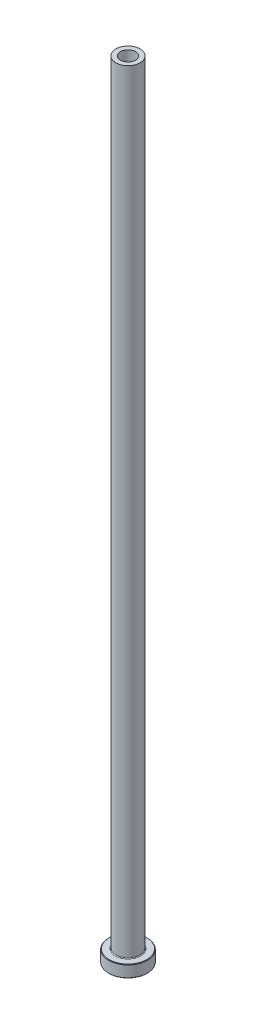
ISO-10303-21;
HEADER;
FILE_DESCRIPTION(('STEP AP214'),'2;1');
FILE_NAME('part.step','',(''),(''),'','','');
FILE_SCHEMA(('AUTOMOTIVE_DESIGN { 1 0 10303 214 1 1 1 1 }'));
ENDSEC;
DATA;
#1=APPLICATION_CONTEXT('core data for automotive mechanical design processes');
#2=APPLICATION_PROTOCOL_DEFINITION('international standard','automotive_design',2000,#1);
#3=PRODUCT_CONTEXT('',#1,'mechanical');
#4=PRODUCT('Part','Part','',(#3));
#5=PRODUCT_RELATED_PRODUCT_CATEGORY('part','',(#4));
#6=PRODUCT_DEFINITION_FORMATION('','',#4);
#7=PRODUCT_DEFINITION_CONTEXT('part definition',#1,'design');
#8=PRODUCT_DEFINITION('design','',#6,#7);
#9=PRODUCT_DEFINITION_SHAPE('','',#8);
#10=(LENGTH_UNIT() NAMED_UNIT(*) SI_UNIT(.MILLI.,.METRE.));
#11=(NAMED_UNIT(*) PLANE_ANGLE_UNIT() SI_UNIT($,.RADIAN.));
#12=(NAMED_UNIT(*) SI_UNIT($,.STERADIAN.) SOLID_ANGLE_UNIT());
#13=UNCERTAINTY_MEASURE_WITH_UNIT(LENGTH_MEASURE(1.E-05),#10,'distance_accuracy_value','');
#14=(GEOMETRIC_REPRESENTATION_CONTEXT(3) GLOBAL_UNCERTAINTY_ASSIGNED_CONTEXT((#13)) GLOBAL_UNIT_ASSIGNED_CONTEXT((#10,
#11,#12)) REPRESENTATION_CONTEXT('',''));
#15=CARTESIAN_POINT('',(0.,0.,0.));
#16=DIRECTION('',(0.,0.,1.));
#17=DIRECTION('',(1.,0.,0.));
#18=AXIS2_PLACEMENT_3D('',#15,#16,#17);
#19=CARTESIAN_POINT('',(0.,92.1876809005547,0.));
#20=DIRECTION('',(0.,1.,0.));
#21=DIRECTION('',(0.,0.,1.));
#22=AXIS2_PLACEMENT_3D('',#19,#20,#21);
#23=CYLINDRICAL_SURFACE('',#22,3.10000000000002);
#24=CARTESIAN_POINT('',(0.,325.,0.));
#25=DIRECTION('',(0.,1.,0.));
#26=DIRECTION('',(0.,0.,1.));
#27=AXIS2_PLACEMENT_3D('',#24,#25,#26);
#28=CIRCLE('',#27,3.10000000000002);
#29=CARTESIAN_POINT('',(0.,325.,3.10000000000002));
#30=VERTEX_POINT('',#29);
#31=EDGE_CURVE('E62',#30,#30,#28,.T.);
#32=ORIENTED_EDGE('',*,*,#31,.T.);
#33=EDGE_LOOP('',(#32));
#34=FACE_BOUND('',#33,.T.);
#35=CARTESIAN_POINT('',(0.,280.,0.));
#36=DIRECTION('',(0.,1.,0.));
#37=DIRECTION('',(0.,0.,1.));
#38=AXIS2_PLACEMENT_3D('',#35,#36,#37);
#39=CIRCLE('',#38,3.10000000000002);
#40=CARTESIAN_POINT('',(0.,280.,3.10000000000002));
#41=VERTEX_POINT('',#40);
#42=EDGE_CURVE('E71',#41,#41,#39,.T.);
#43=ORIENTED_EDGE('',*,*,#42,.F.);
#44=EDGE_LOOP('',(#43));
#45=FACE_BOUND('',#44,.T.);
#46=ADVANCED_FACE('F30',(#34,#45),#23,.F.);
#47=CARTESIAN_POINT('',(-3.10000000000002,325.,0.));
#48=DIRECTION('',(0.,1.,0.));
#49=DIRECTION('',(0.,0.,1.));
#50=AXIS2_PLACEMENT_3D('',#47,#48,#49);
#51=PLANE('',#50);
#52=CARTESIAN_POINT('',(0.,325.,0.));
#53=DIRECTION('',(0.,1.,0.));
#54=DIRECTION('',(0.,0.,1.));
#55=AXIS2_PLACEMENT_3D('',#52,#53,#54);
#56=CIRCLE('',#55,5.00000000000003);
#57=CARTESIAN_POINT('',(0.,325.,5.00000000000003));
#58=VERTEX_POINT('',#57);
#59=EDGE_CURVE('E65',#58,#58,#56,.T.);
#60=ORIENTED_EDGE('',*,*,#59,.T.);
#61=EDGE_LOOP('',(#60));
#62=FACE_BOUND('',#61,.T.);
#63=ORIENTED_EDGE('',*,*,#31,.F.);
#64=EDGE_LOOP('',(#63));
#65=FACE_BOUND('',#64,.T.);
#66=ADVANCED_FACE('F79',(#62,#65),#51,.T.);
#67=CARTESIAN_POINT('',(0.,92.1876809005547,0.));
#68=DIRECTION('',(0.,1.,0.));
#69=DIRECTION('',(0.,0.,1.));
#70=AXIS2_PLACEMENT_3D('',#67,#68,#69);
#71=CYLINDRICAL_SURFACE('',#70,5.00000000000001);
#72=CARTESIAN_POINT('',(0.,5.3,0.));
#73=DIRECTION('',(0.,1.,0.));
#74=DIRECTION('',(0.,0.,1.));
#75=AXIS2_PLACEMENT_3D('',#72,#73,#74);
#76=CIRCLE('',#75,5.00000000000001);
#77=CARTESIAN_POINT('',(0.,5.3,5.00000000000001));
#78=VERTEX_POINT('',#77);
#79=EDGE_CURVE('E59',#78,#78,#76,.T.);
#80=ORIENTED_EDGE('',*,*,#79,.T.);
#81=EDGE_LOOP('',(#80));
#82=FACE_BOUND('',#81,.T.);
#83=ORIENTED_EDGE('',*,*,#59,.F.);
#84=EDGE_LOOP('',(#83));
#85=FACE_BOUND('',#84,.T.);
#86=ADVANCED_FACE('F85',(#82,#85),#71,.T.);
#87=CARTESIAN_POINT('',(-4.99999999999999,5.,0.));
#88=DIRECTION('',(0.,1.,0.));
#89=DIRECTION('',(0.,0.,1.));
#90=AXIS2_PLACEMENT_3D('',#87,#88,#89);
#91=PLANE('',#90);
#92=CARTESIAN_POINT('',(0.,5.,0.));
#93=DIRECTION('',(0.,1.,0.));
#94=DIRECTION('',(0.,0.,1.));
#95=AXIS2_PLACEMENT_3D('',#92,#93,#94);
#96=CIRCLE('',#95,7.79999999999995);
#97=CARTESIAN_POINT('',(0.,5.,7.79999999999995));
#98=VERTEX_POINT('',#97);
#99=EDGE_CURVE('E53',#98,#98,#96,.T.);
#100=ORIENTED_EDGE('',*,*,#99,.T.);
#101=EDGE_LOOP('',(#100));
#102=FACE_BOUND('',#101,.T.);
#103=CARTESIAN_POINT('',(0.,5.,0.));
#104=DIRECTION('',(0.,1.,0.));
#105=DIRECTION('',(0.,0.,1.));
#106=AXIS2_PLACEMENT_3D('',#103,#104,#105);
#107=CIRCLE('',#106,5.30000000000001);
#108=CARTESIAN_POINT('',(0.,5.,5.30000000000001));
#109=VERTEX_POINT('',#108);
#110=EDGE_CURVE('E56',#109,#109,#107,.F.);
#111=ORIENTED_EDGE('',*,*,#110,.T.);
#112=EDGE_LOOP('',(#111));
#113=FACE_BOUND('',#112,.T.);
#114=ADVANCED_FACE('F111',(#102,#113),#91,.T.);
#115=CARTESIAN_POINT('',(0.,92.1876809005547,0.));
#116=DIRECTION('',(0.,1.,0.));
#117=DIRECTION('',(0.,0.,1.));
#118=AXIS2_PLACEMENT_3D('',#115,#116,#117);
#119=CYLINDRICAL_SURFACE('',#118,7.99999999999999);
#120=CARTESIAN_POINT('',(0.,4.79999999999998,0.));
#121=DIRECTION('',(0.,1.,0.));
#122=DIRECTION('',(0.,0.,1.));
#123=AXIS2_PLACEMENT_3D('',#120,#121,#122);
#124=CIRCLE('',#123,7.99999999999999);
#125=CARTESIAN_POINT('',(0.,4.79999999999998,7.99999999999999));
#126=VERTEX_POINT('',#125);
#127=EDGE_CURVE('E45',#126,#126,#124,.F.);
#128=ORIENTED_EDGE('',*,*,#127,.T.);
#129=EDGE_LOOP('',(#128));
#130=FACE_BOUND('',#129,.T.);
#131=CARTESIAN_POINT('',(0.,0.199999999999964,0.));
#132=DIRECTION('',(0.,-1.,0.));
#133=DIRECTION('',(0.,0.,-1.));
#134=AXIS2_PLACEMENT_3D('',#131,#132,#133);
#135=CIRCLE('',#134,7.99999999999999);
#136=CARTESIAN_POINT('',(0.,0.199999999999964,-7.99999999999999));
#137=VERTEX_POINT('',#136);
#138=EDGE_CURVE('E50',#137,#137,#135,.F.);
#139=ORIENTED_EDGE('',*,*,#138,.T.);
#140=EDGE_LOOP('',(#139));
#141=FACE_BOUND('',#140,.T.);
#142=ADVANCED_FACE('F108',(#130,#141),#119,.T.);
#143=CARTESIAN_POINT('',(-7.99999999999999,0.,0.));
#144=DIRECTION('',(0.,-1.,0.));
#145=DIRECTION('',(0.,0.,-1.));
#146=AXIS2_PLACEMENT_3D('',#143,#144,#145);
#147=PLANE('',#146);
#148=CARTESIAN_POINT('',(0.,0.,0.));
#149=DIRECTION('',(0.,-1.,0.));
#150=DIRECTION('',(0.,0.,-1.));
#151=AXIS2_PLACEMENT_3D('',#148,#149,#150);
#152=CIRCLE('',#151,3.85000000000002);
#153=CARTESIAN_POINT('',(0.,0.,-3.85000000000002));
#154=VERTEX_POINT('',#153);
#155=EDGE_CURVE('E37',#154,#154,#152,.F.);
#156=ORIENTED_EDGE('',*,*,#155,.T.);
#157=EDGE_LOOP('',(#156));
#158=FACE_BOUND('',#157,.T.);
#159=CARTESIAN_POINT('',(0.,0.,0.));
#160=DIRECTION('',(0.,-1.,0.));
#161=DIRECTION('',(0.,0.,-1.));
#162=AXIS2_PLACEMENT_3D('',#159,#160,#161);
#163=CIRCLE('',#162,7.8);
#164=CARTESIAN_POINT('',(0.,0.,-7.8));
#165=VERTEX_POINT('',#164);
#166=EDGE_CURVE('E41',#165,#165,#163,.T.);
#167=ORIENTED_EDGE('',*,*,#166,.T.);
#168=EDGE_LOOP('',(#167));
#169=FACE_BOUND('',#168,.T.);
#170=ADVANCED_FACE('F110',(#158,#169),#147,.T.);
#171=CARTESIAN_POINT('',(0.,92.1876809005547,0.));
#172=DIRECTION('',(0.,1.,0.));
#173=DIRECTION('',(0.,0.,1.));
#174=AXIS2_PLACEMENT_3D('',#171,#172,#173);
#175=CYLINDRICAL_SURFACE('',#174,3.35000000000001);
#176=CARTESIAN_POINT('',(0.,0.499999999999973,0.));
#177=DIRECTION('',(0.,-1.,0.));
#178=DIRECTION('',(0.,0.,-1.));
#179=AXIS2_PLACEMENT_3D('',#176,#177,#178);
#180=CIRCLE('',#179,3.35000000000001);
#181=CARTESIAN_POINT('',(0.,0.499999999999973,-3.35000000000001));
#182=VERTEX_POINT('',#181);
#183=EDGE_CURVE('E10',#182,#182,#180,.T.);
#184=ORIENTED_EDGE('',*,*,#183,.T.);
#185=EDGE_LOOP('',(#184));
#186=FACE_BOUND('',#185,.T.);
#187=CARTESIAN_POINT('',(0.,268.,0.));
#188=DIRECTION('',(0.,1.,0.));
#189=DIRECTION('',(0.,0.,1.));
#190=AXIS2_PLACEMENT_3D('',#187,#188,#189);
#191=CIRCLE('',#190,3.35000000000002);
#192=CARTESIAN_POINT('',(0.,268.,3.35000000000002));
#193=VERTEX_POINT('',#192);
#194=EDGE_CURVE('E68',#193,#193,#191,.T.);
#195=ORIENTED_EDGE('',*,*,#194,.T.);
#196=EDGE_LOOP('',(#195));
#197=FACE_BOUND('',#196,.T.);
#198=ADVANCED_FACE('F118',(#186,#197),#175,.F.);
#199=CARTESIAN_POINT('',(0.,268.,0.));
#200=DIRECTION('',(0.,-1.,0.));
#201=DIRECTION('',(0.,0.,-1.));
#202=AXIS2_PLACEMENT_3D('',#199,#200,#201);
#203=CONICAL_SURFACE('',#202,3.35000000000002,0.0208303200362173);
#204=ORIENTED_EDGE('',*,*,#42,.T.);
#205=EDGE_LOOP('',(#204));
#206=FACE_BOUND('',#205,.T.);
#207=ORIENTED_EDGE('',*,*,#194,.F.);
#208=EDGE_LOOP('',(#207));
#209=FACE_BOUND('',#208,.T.);
#210=ADVANCED_FACE('F75',(#206,#209),#203,.F.);
#211=CARTESIAN_POINT('',(0.,5.3,0.));
#212=DIRECTION('',(0.,1.,0.));
#213=DIRECTION('',(0.,0.,1.));
#214=AXIS2_PLACEMENT_3D('',#211,#212,#213);
#215=TOROIDAL_SURFACE('',#214,5.30000000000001,0.3);
#216=ORIENTED_EDGE('',*,*,#110,.F.);
#217=EDGE_LOOP('',(#216));
#218=FACE_BOUND('',#217,.T.);
#219=ORIENTED_EDGE('',*,*,#79,.F.);
#220=EDGE_LOOP('',(#219));
#221=FACE_BOUND('',#220,.T.);
#222=ADVANCED_FACE('F90',(#218,#221),#215,.F.);
#223=CARTESIAN_POINT('',(0.,5.,0.));
#224=DIRECTION('',(0.,-1.,0.));
#225=DIRECTION('',(0.,0.,-1.));
#226=AXIS2_PLACEMENT_3D('',#223,#224,#225);
#227=CONICAL_SURFACE('',#226,7.79999999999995,0.785398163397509);
#228=ORIENTED_EDGE('',*,*,#127,.F.);
#229=EDGE_LOOP('',(#228));
#230=FACE_BOUND('',#229,.T.);
#231=ORIENTED_EDGE('',*,*,#99,.F.);
#232=EDGE_LOOP('',(#231));
#233=FACE_BOUND('',#232,.T.);
#234=ADVANCED_FACE('F93',(#230,#233),#227,.T.);
#235=CARTESIAN_POINT('',(0.,0.199999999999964,0.));
#236=DIRECTION('',(0.,1.,0.));
#237=DIRECTION('',(0.,0.,1.));
#238=AXIS2_PLACEMENT_3D('',#235,#236,#237);
#239=CONICAL_SURFACE('',#238,7.99999999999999,0.785398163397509);
#240=ORIENTED_EDGE('',*,*,#166,.F.);
#241=EDGE_LOOP('',(#240));
#242=FACE_BOUND('',#241,.T.);
#243=ORIENTED_EDGE('',*,*,#138,.F.);
#244=EDGE_LOOP('',(#243));
#245=FACE_BOUND('',#244,.T.);
#246=ADVANCED_FACE('F96',(#242,#245),#239,.T.);
#247=CARTESIAN_POINT('',(0.,0.,0.));
#248=DIRECTION('',(0.,-1.,0.));
#249=DIRECTION('',(0.,0.,-1.));
#250=AXIS2_PLACEMENT_3D('',#247,#248,#249);
#251=CONICAL_SURFACE('',#250,3.85000000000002,0.78539816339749);
#252=ORIENTED_EDGE('',*,*,#183,.F.);
#253=EDGE_LOOP('',(#252));
#254=FACE_BOUND('',#253,.T.);
#255=ORIENTED_EDGE('',*,*,#155,.F.);
#256=EDGE_LOOP('',(#255));
#257=FACE_BOUND('',#256,.T.);
#258=ADVANCED_FACE('F32',(#254,#257),#251,.F.);
#259=CLOSED_SHELL('',(#46,#66,#86,#114,#142,#170,#198,#210,#222,#234,#246,#258));
#260=MANIFOLD_SOLID_BREP('B2',#259);
#261=ADVANCED_BREP_SHAPE_REPRESENTATION('',(#18,#260),#14);
#262=SHAPE_DEFINITION_REPRESENTATION(#9,#261);
ENDSEC;
END-ISO-10303-21;
